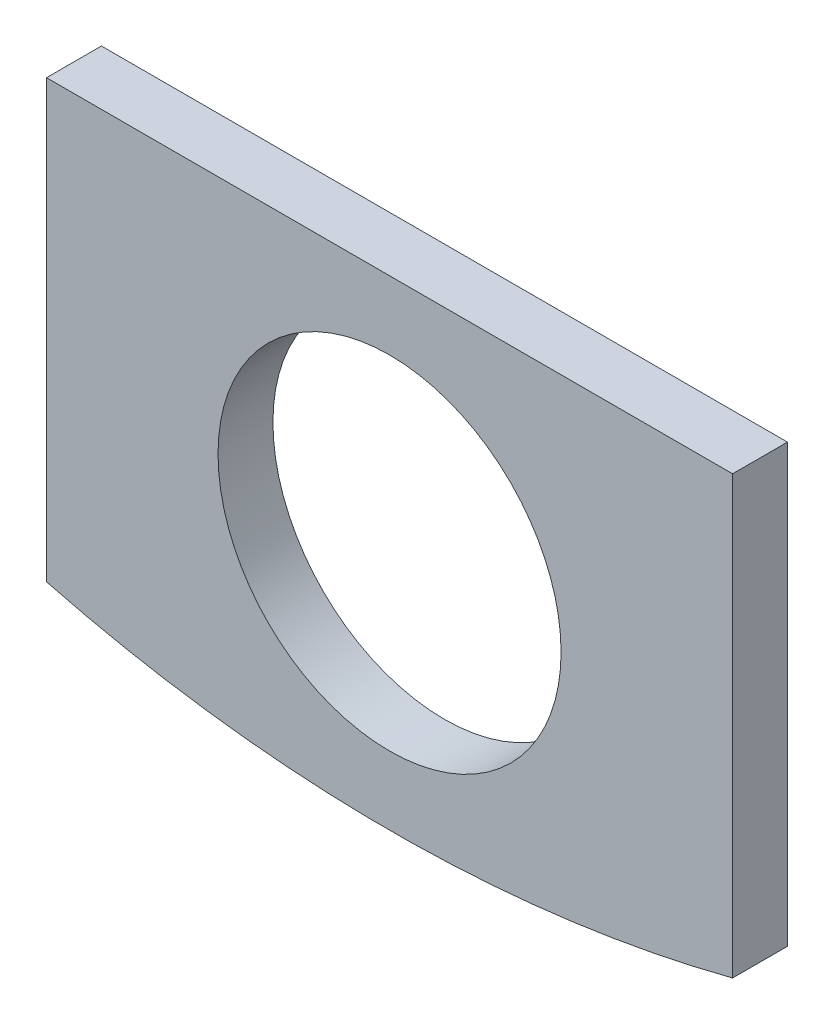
from build123d import *

# Parameters (mm, degrees)
BASE_EXTRUDE_DEPTH = 4
SKETCH3_R          = 12.5
CUT_EXTRUDE1_DEPTH = 44.197222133


with BuildPart() as part:
    # Sketch1 → Base-Extrude (new body)
    with BuildSketch(Plane.XY):
        with BuildLine():
            Line((-25, 3.175416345), (-25, 35))
            Line((-25, 35), (25, 35))
            Line((25, 35), (25, 3.175416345))
            ThreePointArc((25, 3.175416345), (0, 0), (-25, 3.175416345))
        make_face()
    extrude(amount=BASE_EXTRUDE_DEPTH)

    # Sketch3 → Cut-Extrude1 (cut, through all)
    with BuildSketch(Plane.XY.offset(4)):
        with Locations((0, 17.5)):
            Circle(SKETCH3_R)
    extrude(amount=-CUT_EXTRUDE1_DEPTH, mode=Mode.SUBTRACT)


solid = part.part
